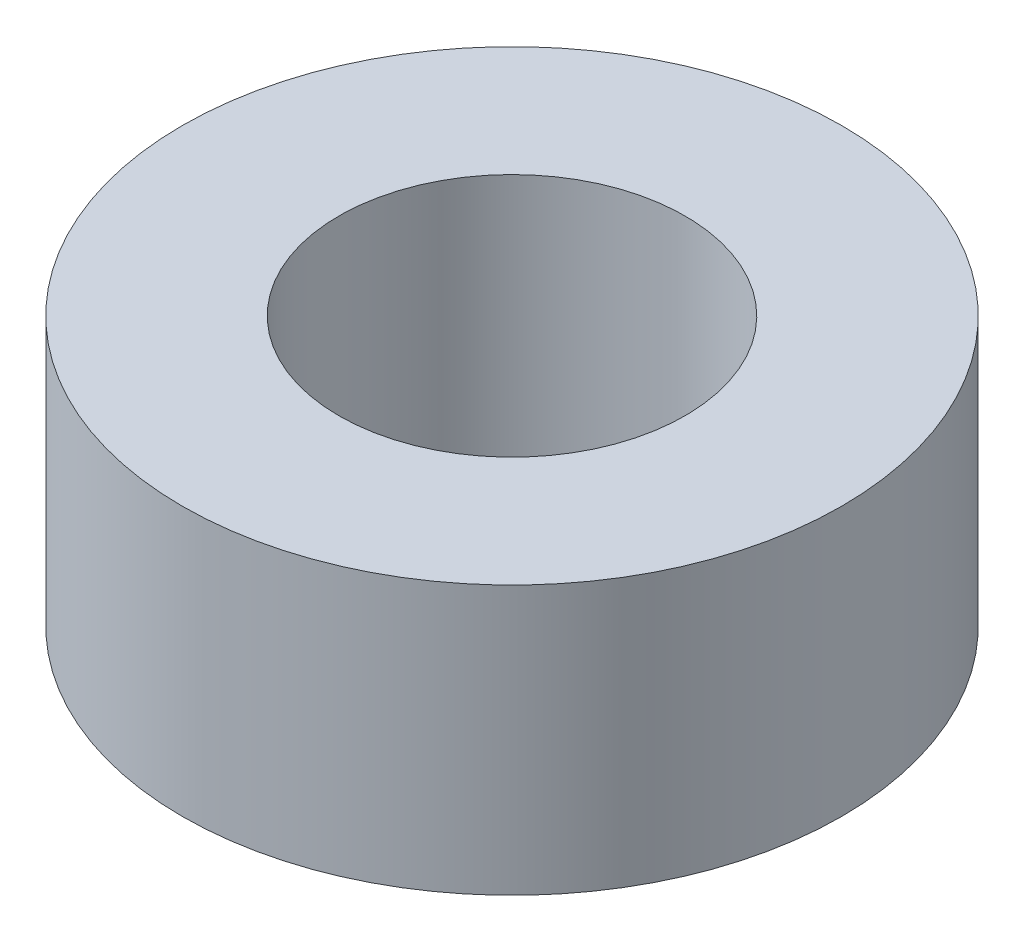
from build123d import *

# Parameters (mm, degrees)
SKETCH1_R           = 4
SKETCH1_R_2         = 2.1
BOSS_EXTRUDE1_DEPTH = 3.26


with BuildPart() as part:
    # Sketch1 → Boss-Extrude1 (new body)
    with BuildSketch(Plane(origin=(0, 0, 0), x_dir=(1, 0, 0), z_dir=(0, 1, 0))):
        with Locations(Location((0, 0, 0), (0, 0, 270))):
            Circle(SKETCH1_R)
        with Locations(Location((0, 0, 0), (0, 0, 270))):
            Circle(SKETCH1_R_2, mode=Mode.SUBTRACT)
    extrude(amount=BOSS_EXTRUDE1_DEPTH)


solid = part.part
